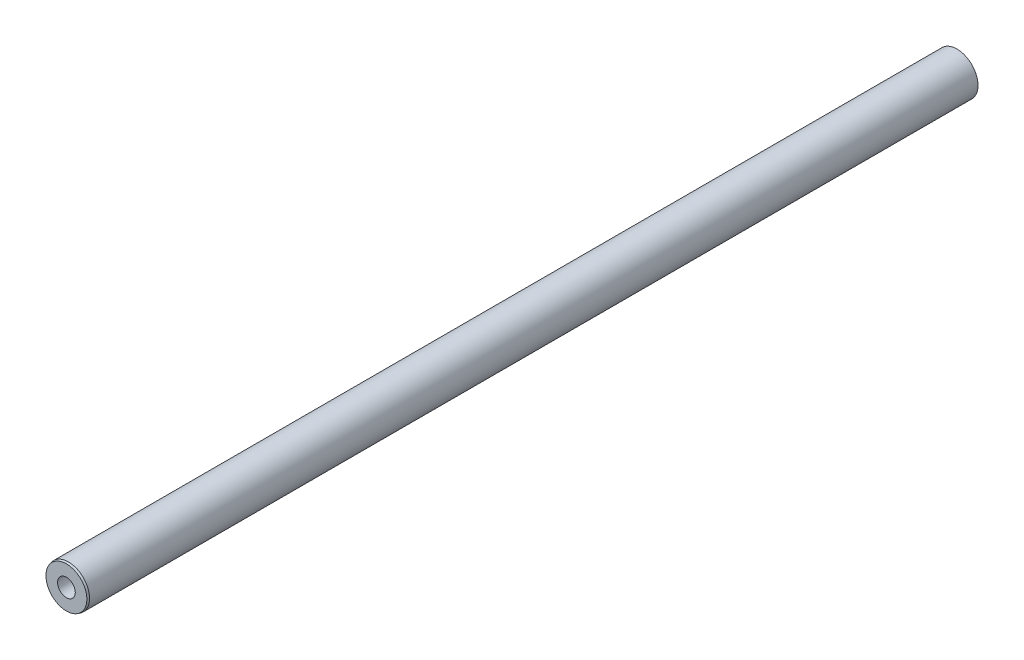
ISO-10303-21;
HEADER;
FILE_DESCRIPTION(('STEP AP214'),'2;1');
FILE_NAME('part.step','',(''),(''),'','','');
FILE_SCHEMA(('AUTOMOTIVE_DESIGN { 1 0 10303 214 1 1 1 1 }'));
ENDSEC;
DATA;
#1=APPLICATION_CONTEXT('core data for automotive mechanical design processes');
#2=APPLICATION_PROTOCOL_DEFINITION('international standard','automotive_design',2000,#1);
#3=PRODUCT_CONTEXT('',#1,'mechanical');
#4=PRODUCT('Part','Part','',(#3));
#5=PRODUCT_RELATED_PRODUCT_CATEGORY('part','',(#4));
#6=PRODUCT_DEFINITION_FORMATION('','',#4);
#7=PRODUCT_DEFINITION_CONTEXT('part definition',#1,'design');
#8=PRODUCT_DEFINITION('design','',#6,#7);
#9=PRODUCT_DEFINITION_SHAPE('','',#8);
#10=(LENGTH_UNIT() NAMED_UNIT(*) SI_UNIT(.MILLI.,.METRE.));
#11=(NAMED_UNIT(*) PLANE_ANGLE_UNIT() SI_UNIT($,.RADIAN.));
#12=(NAMED_UNIT(*) SI_UNIT($,.STERADIAN.) SOLID_ANGLE_UNIT());
#13=UNCERTAINTY_MEASURE_WITH_UNIT(LENGTH_MEASURE(1.E-05),#10,'distance_accuracy_value','');
#14=(GEOMETRIC_REPRESENTATION_CONTEXT(3) GLOBAL_UNCERTAINTY_ASSIGNED_CONTEXT((#13)) GLOBAL_UNIT_ASSIGNED_CONTEXT((#10,
#11,#12)) REPRESENTATION_CONTEXT('',''));
#15=CARTESIAN_POINT('',(0.,0.,0.));
#16=DIRECTION('',(0.,0.,1.));
#17=DIRECTION('',(1.,0.,0.));
#18=AXIS2_PLACEMENT_3D('',#15,#16,#17);
#19=CARTESIAN_POINT('',(0.,0.,538.2768));
#20=DIRECTION('',(0.,0.,-1.));
#21=DIRECTION('',(-1.,0.,0.));
#22=AXIS2_PLACEMENT_3D('',#19,#20,#21);
#23=CYLINDRICAL_SURFACE('',#22,12.7);
#24=CARTESIAN_POINT('',(0.,0.,537.0068));
#25=DIRECTION('',(0.,0.,1.));
#26=DIRECTION('',(1.,0.,0.));
#27=AXIS2_PLACEMENT_3D('',#24,#25,#26);
#28=CIRCLE('',#27,12.7);
#29=CARTESIAN_POINT('',(12.7,0.,537.0068));
#30=VERTEX_POINT('',#29);
#31=EDGE_CURVE('E11',#30,#30,#28,.F.);
#32=ORIENTED_EDGE('',*,*,#31,.T.);
#33=EDGE_LOOP('',(#32));
#34=FACE_BOUND('',#33,.T.);
#35=CARTESIAN_POINT('',(0.,0.,0.));
#36=DIRECTION('',(0.,0.,1.));
#37=DIRECTION('',(1.,0.,0.));
#38=AXIS2_PLACEMENT_3D('',#35,#36,#37);
#39=CIRCLE('',#38,12.7);
#40=CARTESIAN_POINT('',(12.7,0.,0.));
#41=VERTEX_POINT('',#40);
#42=EDGE_CURVE('E63',#41,#41,#39,.T.);
#43=ORIENTED_EDGE('',*,*,#42,.T.);
#44=EDGE_LOOP('',(#43));
#45=FACE_BOUND('',#44,.T.);
#46=ADVANCED_FACE('F41',(#34,#45),#23,.T.);
#47=CARTESIAN_POINT('',(0.,0.,538.2768));
#48=DIRECTION('',(0.,0.,1.));
#49=DIRECTION('',(1.,0.,0.));
#50=AXIS2_PLACEMENT_3D('',#47,#48,#49);
#51=PLANE('',#50);
#52=CARTESIAN_POINT('',(0.,0.,538.2768));
#53=DIRECTION('',(0.,0.,1.));
#54=DIRECTION('',(1.,0.,0.));
#55=AXIS2_PLACEMENT_3D('',#52,#53,#54);
#56=CIRCLE('',#55,5.3581253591);
#57=CARTESIAN_POINT('',(5.3581253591,0.,538.2768));
#58=VERTEX_POINT('',#57);
#59=EDGE_CURVE('E60',#58,#58,#56,.T.);
#60=ORIENTED_EDGE('',*,*,#59,.F.);
#61=EDGE_LOOP('',(#60));
#62=FACE_BOUND('',#61,.T.);
#63=CARTESIAN_POINT('',(0.,0.,538.2768));
#64=DIRECTION('',(0.,0.,1.));
#65=DIRECTION('',(1.,0.,0.));
#66=AXIS2_PLACEMENT_3D('',#63,#64,#65);
#67=CIRCLE('',#66,12.3597045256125);
#68=CARTESIAN_POINT('',(12.3597045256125,0.,538.2768));
#69=VERTEX_POINT('',#68);
#70=EDGE_CURVE('E48',#69,#69,#67,.T.);
#71=ORIENTED_EDGE('',*,*,#70,.T.);
#72=EDGE_LOOP('',(#71));
#73=FACE_BOUND('',#72,.T.);
#74=ADVANCED_FACE('F70',(#62,#73),#51,.T.);
#75=CARTESIAN_POINT('',(0.,0.,0.));
#76=DIRECTION('',(0.,0.,1.));
#77=DIRECTION('',(1.,0.,0.));
#78=AXIS2_PLACEMENT_3D('',#75,#76,#77);
#79=PLANE('',#78);
#80=ORIENTED_EDGE('',*,*,#42,.F.);
#81=EDGE_LOOP('',(#80));
#82=FACE_BOUND('',#81,.T.);
#83=ADVANCED_FACE('F73',(#82),#79,.F.);
#84=CARTESIAN_POINT('',(0.,0.,538.2768));
#85=DIRECTION('',(0.,0.,-1.));
#86=DIRECTION('',(-1.,0.,0.));
#87=AXIS2_PLACEMENT_3D('',#84,#85,#86);
#88=CONICAL_SURFACE('',#87,12.3597045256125,0.261799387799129);
#89=ORIENTED_EDGE('',*,*,#31,.F.);
#90=EDGE_LOOP('',(#89));
#91=FACE_BOUND('',#90,.T.);
#92=ORIENTED_EDGE('',*,*,#70,.F.);
#93=EDGE_LOOP('',(#92));
#94=FACE_BOUND('',#93,.T.);
#95=ADVANCED_FACE('F43',(#91,#94),#88,.T.);
#96=CARTESIAN_POINT('',(0.,0.,538.2768));
#97=DIRECTION('',(0.,0.,1.));
#98=DIRECTION('',(1.,0.,0.));
#99=AXIS2_PLACEMENT_3D('',#96,#97,#98);
#100=CYLINDRICAL_SURFACE('',#99,5.35812535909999);
#101=CARTESIAN_POINT('',(0.,0.,512.876822));
#102=DIRECTION('',(0.,0.,1.));
#103=DIRECTION('',(1.,0.,0.));
#104=AXIS2_PLACEMENT_3D('',#101,#102,#103);
#105=CIRCLE('',#104,5.35812535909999);
#106=CARTESIAN_POINT('',(5.35812535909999,0.,512.876822));
#107=VERTEX_POINT('',#106);
#108=EDGE_CURVE('E58',#107,#107,#105,.T.);
#109=ORIENTED_EDGE('',*,*,#108,.F.);
#110=EDGE_LOOP('',(#109));
#111=FACE_BOUND('',#110,.T.);
#112=ORIENTED_EDGE('',*,*,#59,.T.);
#113=EDGE_LOOP('',(#112));
#114=FACE_BOUND('',#113,.T.);
#115=ADVANCED_FACE('F54',(#111,#114),#100,.F.);
#116=CARTESIAN_POINT('',(0.,0.,512.876822));
#117=DIRECTION('',(0.,0.,1.));
#118=DIRECTION('',(1.,0.,0.));
#119=AXIS2_PLACEMENT_3D('',#116,#117,#118);
#120=CONICAL_SURFACE('',#119,5.35812535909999,1.02974425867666);
#121=CARTESIAN_POINT('',(0.,0.,509.657335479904));
#122=VERTEX_POINT('',#121);
#123=VERTEX_LOOP('',#122);
#124=FACE_BOUND('',#123,.T.);
#125=ORIENTED_EDGE('',*,*,#108,.T.);
#126=EDGE_LOOP('',(#125));
#127=FACE_BOUND('',#126,.T.);
#128=ADVANCED_FACE('F51',(#124,#127),#120,.F.);
#129=CLOSED_SHELL('',(#46,#74,#83,#95,#115,#128));
#130=MANIFOLD_SOLID_BREP('B2',#129);
#131=ADVANCED_BREP_SHAPE_REPRESENTATION('',(#18,#130),#14);
#132=SHAPE_DEFINITION_REPRESENTATION(#9,#131);
ENDSEC;
END-ISO-10303-21;
